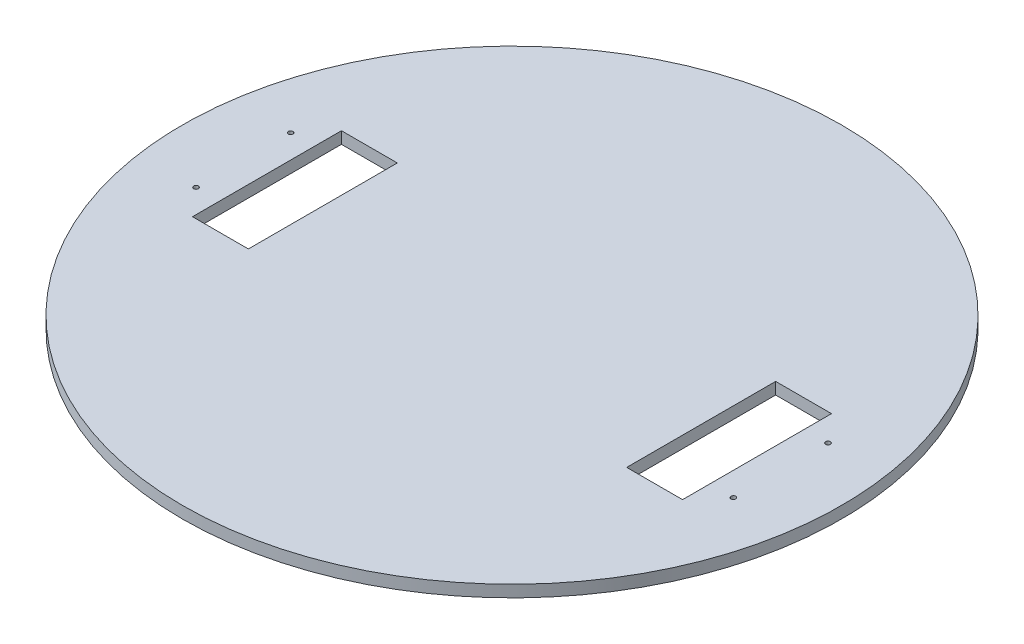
from build123d import *

# Parameters (mm, degrees)
SKETCH1_R           = 177
SKETCH1_R_2         = 1.27
SKETCH1_W           = 30
SKETCH1_H           = 80
BOSS_EXTRUDE1_DEPTH = 6.35


with BuildPart() as part:
    # Sketch1 → Boss-Extrude1 (new body)
    with BuildSketch(Plane(origin=(0, 0, 0), x_dir=(1, 0, 0), z_dir=(0, 1, 0))):
        with Locations(Location((0, 0, 0), (0, 0, 270))):
            Circle(SKETCH1_R)
        with Locations(Location((-144.3, 25.4, 0), (0, 0, 270))):
            Circle(SKETCH1_R_2, mode=Mode.SUBTRACT)
        with Locations(Location((-144.3, -25.4, 0), (0, 0, 270))):
            Circle(SKETCH1_R_2, mode=Mode.SUBTRACT)
        with Locations(Location((144.3, 25.4, 0), (0, 0, 270))):
            Circle(SKETCH1_R_2, mode=Mode.SUBTRACT)
        with Locations(Location((144.3, -25.4, 0), (0, 0, 270))):
            Circle(SKETCH1_R_2, mode=Mode.SUBTRACT)
        with Locations((-116.6, 0)):
            Rectangle(SKETCH1_W, SKETCH1_H, mode=Mode.SUBTRACT)
        with Locations((116.6, 0)):
            Rectangle(SKETCH1_W, SKETCH1_H, mode=Mode.SUBTRACT)
    extrude(amount=BOSS_EXTRUDE1_DEPTH)


solid = part.part
